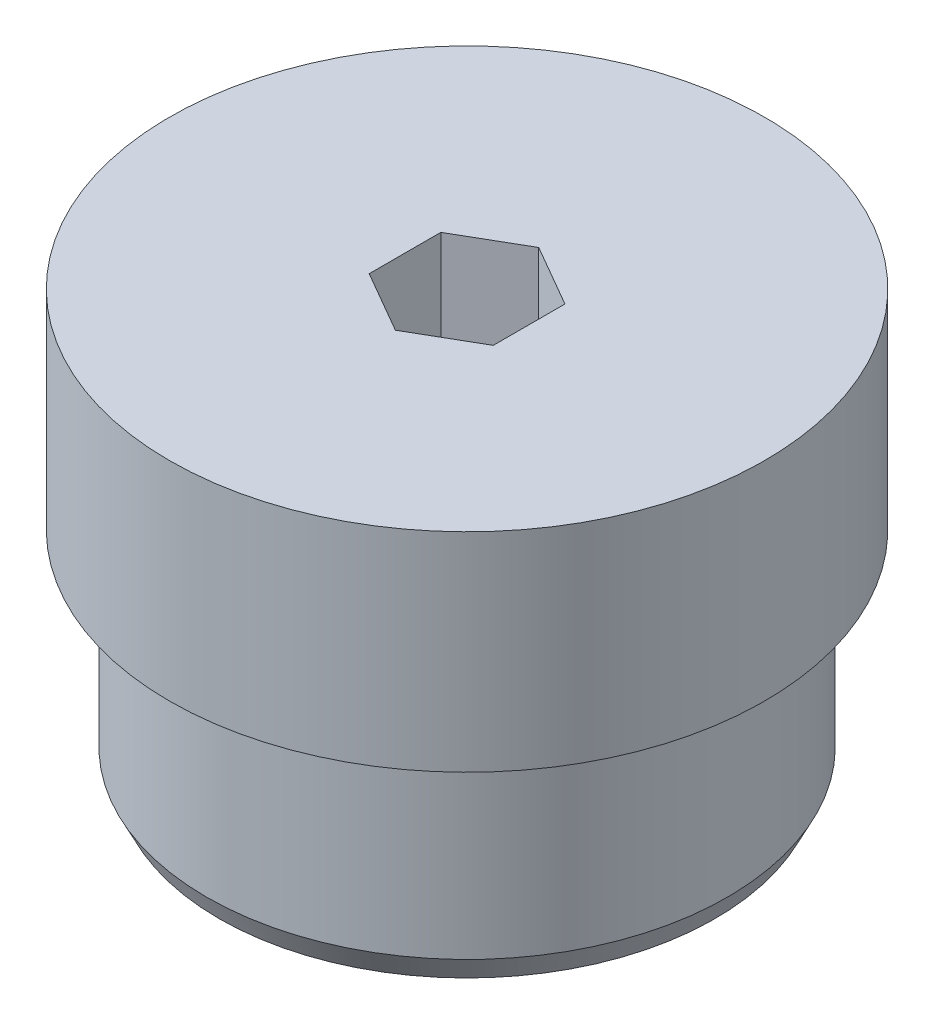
ISO-10303-21;
HEADER;
FILE_DESCRIPTION(('STEP AP214'),'2;1');
FILE_NAME('part.step','',(''),(''),'','','');
FILE_SCHEMA(('AUTOMOTIVE_DESIGN { 1 0 10303 214 1 1 1 1 }'));
ENDSEC;
DATA;
#1=APPLICATION_CONTEXT('core data for automotive mechanical design processes');
#2=APPLICATION_PROTOCOL_DEFINITION('international standard','automotive_design',2000,#1);
#3=PRODUCT_CONTEXT('',#1,'mechanical');
#4=PRODUCT('Part','Part','',(#3));
#5=PRODUCT_RELATED_PRODUCT_CATEGORY('part','',(#4));
#6=PRODUCT_DEFINITION_FORMATION('','',#4);
#7=PRODUCT_DEFINITION_CONTEXT('part definition',#1,'design');
#8=PRODUCT_DEFINITION('design','',#6,#7);
#9=PRODUCT_DEFINITION_SHAPE('','',#8);
#10=(LENGTH_UNIT() NAMED_UNIT(*) SI_UNIT(.MILLI.,.METRE.));
#11=(NAMED_UNIT(*) PLANE_ANGLE_UNIT() SI_UNIT($,.RADIAN.));
#12=(NAMED_UNIT(*) SI_UNIT($,.STERADIAN.) SOLID_ANGLE_UNIT());
#13=UNCERTAINTY_MEASURE_WITH_UNIT(LENGTH_MEASURE(1.E-05),#10,'distance_accuracy_value','');
#14=(GEOMETRIC_REPRESENTATION_CONTEXT(3) GLOBAL_UNCERTAINTY_ASSIGNED_CONTEXT((#13)) GLOBAL_UNIT_ASSIGNED_CONTEXT((#10,
#11,#12)) REPRESENTATION_CONTEXT('',''));
#15=CARTESIAN_POINT('',(0.,0.,0.));
#16=DIRECTION('',(0.,0.,1.));
#17=DIRECTION('',(1.,0.,0.));
#18=AXIS2_PLACEMENT_3D('',#15,#16,#17);
#19=CARTESIAN_POINT('',(-1.99999999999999,5.70470053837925,0.));
#20=DIRECTION('',(0.,-1.,0.));
#21=DIRECTION('',(0.,0.,-1.));
#22=AXIS2_PLACEMENT_3D('',#19,#20,#21);
#23=PLANE('',#22);
#24=DIRECTION('',(-0.866025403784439,0.,-0.5));
#25=VECTOR('',#24,1.);
#26=CARTESIAN_POINT('',(-2.12570335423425,5.70470053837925,0.217724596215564));
#27=LINE('',#26,#25);
#28=CARTESIAN_POINT('',(0.,5.70470053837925,1.445));
#29=VERTEX_POINT('',#28);
#30=CARTESIAN_POINT('',(-1.25140670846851,5.70470053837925,0.722499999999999));
#31=VERTEX_POINT('',#30);
#32=EDGE_CURVE('E129',#29,#31,#27,.T.);
#33=ORIENTED_EDGE('',*,*,#32,.F.);
#34=DIRECTION('',(-0.866025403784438,0.,0.500000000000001));
#35=VECTOR('',#34,1.);
#36=CARTESIAN_POINT('',(-0.874296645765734,5.70470053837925,1.94977540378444));
#37=LINE('',#36,#35);
#38=CARTESIAN_POINT('',(1.25140670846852,5.70470053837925,0.7225));
#39=VERTEX_POINT('',#38);
#40=EDGE_CURVE('E114',#39,#29,#37,.T.);
#41=ORIENTED_EDGE('',*,*,#40,.F.);
#42=DIRECTION('',(0.,0.,1.));
#43=VECTOR('',#42,1.);
#44=CARTESIAN_POINT('',(1.25140670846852,5.70470053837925,0.));
#45=LINE('',#44,#43);
#46=CARTESIAN_POINT('',(1.25140670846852,5.70470053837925,-0.722500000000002));
#47=VERTEX_POINT('',#46);
#48=EDGE_CURVE('E87',#47,#39,#45,.T.);
#49=ORIENTED_EDGE('',*,*,#48,.F.);
#50=DIRECTION('',(0.866025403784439,0.,0.499999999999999));
#51=VECTOR('',#50,1.);
#52=CARTESIAN_POINT('',(-0.874296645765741,5.70470053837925,-1.94977540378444));
#53=LINE('',#52,#51);
#54=CARTESIAN_POINT('',(0.,5.70470053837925,-1.445));
#55=VERTEX_POINT('',#54);
#56=EDGE_CURVE('E123',#55,#47,#53,.T.);
#57=ORIENTED_EDGE('',*,*,#56,.F.);
#58=DIRECTION('',(0.866025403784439,0.,-0.5));
#59=VECTOR('',#58,1.);
#60=CARTESIAN_POINT('',(-2.12570335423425,5.70470053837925,-0.217724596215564));
#61=LINE('',#60,#59);
#62=CARTESIAN_POINT('',(-1.25140670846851,5.70470053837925,-0.722500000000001));
#63=VERTEX_POINT('',#62);
#64=EDGE_CURVE('E125',#63,#55,#61,.T.);
#65=ORIENTED_EDGE('',*,*,#64,.F.);
#66=DIRECTION('',(0.,0.,-1.));
#67=VECTOR('',#66,1.);
#68=CARTESIAN_POINT('',(-1.25140670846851,5.70470053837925,0.));
#69=LINE('',#68,#67);
#70=EDGE_CURVE('E127',#31,#63,#69,.T.);
#71=ORIENTED_EDGE('',*,*,#70,.F.);
#72=EDGE_LOOP('',(#33,#41,#49,#57,#65,#71));
#73=FACE_BOUND('',#72,.T.);
#74=CARTESIAN_POINT('',(0.,5.70470053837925,0.));
#75=DIRECTION('',(0.,1.,0.));
#76=DIRECTION('',(0.,0.,1.));
#77=AXIS2_PLACEMENT_3D('',#74,#75,#76);
#78=CIRCLE('',#77,1.99999999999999);
#79=CARTESIAN_POINT('',(0.,5.70470053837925,1.99999999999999));
#80=VERTEX_POINT('',#79);
#81=EDGE_CURVE('E131',#80,#80,#78,.T.);
#82=ORIENTED_EDGE('',*,*,#81,.F.);
#83=EDGE_LOOP('',(#82));
#84=FACE_BOUND('',#83,.T.);
#85=ADVANCED_FACE('F29',(#73,#84),#23,.T.);
#86=CARTESIAN_POINT('',(-6.,8.5,0.));
#87=DIRECTION('',(0.,1.,0.));
#88=DIRECTION('',(0.,0.,1.));
#89=AXIS2_PLACEMENT_3D('',#86,#87,#88);
#90=PLANE('',#89);
#91=DIRECTION('',(0.866025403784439,0.,0.5));
#92=VECTOR('',#91,1.);
#93=CARTESIAN_POINT('',(-1.25140670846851,8.5,0.722499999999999));
#94=LINE('',#93,#92);
#95=CARTESIAN_POINT('',(-1.25140670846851,8.5,0.722499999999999));
#96=VERTEX_POINT('',#95);
#97=CARTESIAN_POINT('',(0.,8.5,1.445));
#98=VERTEX_POINT('',#97);
#99=EDGE_CURVE('E51',#96,#98,#94,.T.);
#100=ORIENTED_EDGE('',*,*,#99,.F.);
#101=DIRECTION('',(0.,0.,1.));
#102=VECTOR('',#101,1.);
#103=CARTESIAN_POINT('',(-1.25140670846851,8.5,-0.722500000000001));
#104=LINE('',#103,#102);
#105=CARTESIAN_POINT('',(-1.25140670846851,8.5,-0.722500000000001));
#106=VERTEX_POINT('',#105);
#107=EDGE_CURVE('E109',#106,#96,#104,.T.);
#108=ORIENTED_EDGE('',*,*,#107,.F.);
#109=DIRECTION('',(-0.866025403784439,0.,0.5));
#110=VECTOR('',#109,1.);
#111=CARTESIAN_POINT('',(0.,8.5,-1.445));
#112=LINE('',#111,#110);
#113=CARTESIAN_POINT('',(0.,8.5,-1.445));
#114=VERTEX_POINT('',#113);
#115=EDGE_CURVE('E103',#114,#106,#112,.T.);
#116=ORIENTED_EDGE('',*,*,#115,.F.);
#117=DIRECTION('',(-0.866025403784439,0.,-0.499999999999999));
#118=VECTOR('',#117,1.);
#119=CARTESIAN_POINT('',(1.25140670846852,8.5,-0.722500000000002));
#120=LINE('',#119,#118);
#121=CARTESIAN_POINT('',(1.25140670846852,8.5,-0.722500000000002));
#122=VERTEX_POINT('',#121);
#123=EDGE_CURVE('E101',#122,#114,#120,.T.);
#124=ORIENTED_EDGE('',*,*,#123,.F.);
#125=DIRECTION('',(0.,0.,-1.));
#126=VECTOR('',#125,1.);
#127=CARTESIAN_POINT('',(1.25140670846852,8.5,0.722499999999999));
#128=LINE('',#127,#126);
#129=CARTESIAN_POINT('',(1.25140670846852,8.5,0.722499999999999));
#130=VERTEX_POINT('',#129);
#131=EDGE_CURVE('E84',#130,#122,#128,.T.);
#132=ORIENTED_EDGE('',*,*,#131,.F.);
#133=DIRECTION('',(0.866025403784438,0.,-0.500000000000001));
#134=VECTOR('',#133,1.);
#135=CARTESIAN_POINT('',(0.,8.5,1.445));
#136=LINE('',#135,#134);
#137=EDGE_CURVE('E93',#98,#130,#136,.T.);
#138=ORIENTED_EDGE('',*,*,#137,.F.);
#139=EDGE_LOOP('',(#100,#108,#116,#124,#132,#138));
#140=FACE_BOUND('',#139,.T.);
#141=CARTESIAN_POINT('',(0.,8.5,0.));
#142=DIRECTION('',(0.,1.,0.));
#143=DIRECTION('',(0.,0.,1.));
#144=AXIS2_PLACEMENT_3D('',#141,#142,#143);
#145=CIRCLE('',#144,6.);
#146=CARTESIAN_POINT('',(0.,8.5,6.));
#147=VERTEX_POINT('',#146);
#148=EDGE_CURVE('E11',#147,#147,#145,.T.);
#149=ORIENTED_EDGE('',*,*,#148,.T.);
#150=EDGE_LOOP('',(#149));
#151=FACE_BOUND('',#150,.T.);
#152=ADVANCED_FACE('F97',(#140,#151),#90,.T.);
#153=CARTESIAN_POINT('',(0.,30.,0.));
#154=DIRECTION('',(0.,1.,0.));
#155=DIRECTION('',(0.,0.,1.));
#156=AXIS2_PLACEMENT_3D('',#153,#154,#155);
#157=CYLINDRICAL_SURFACE('',#156,6.);
#158=CARTESIAN_POINT('',(0.,4.3,0.));
#159=DIRECTION('',(0.,1.,0.));
#160=DIRECTION('',(0.,0.,1.));
#161=AXIS2_PLACEMENT_3D('',#158,#159,#160);
#162=CIRCLE('',#161,6.);
#163=CARTESIAN_POINT('',(0.,4.3,6.));
#164=VERTEX_POINT('',#163);
#165=EDGE_CURVE('E36',#164,#164,#162,.T.);
#166=ORIENTED_EDGE('',*,*,#165,.T.);
#167=EDGE_LOOP('',(#166));
#168=FACE_BOUND('',#167,.T.);
#169=ORIENTED_EDGE('',*,*,#148,.F.);
#170=EDGE_LOOP('',(#169));
#171=FACE_BOUND('',#170,.T.);
#172=ADVANCED_FACE('F154',(#168,#171),#157,.T.);
#173=CARTESIAN_POINT('',(-5.25,4.3,0.));
#174=DIRECTION('',(0.,-1.,0.));
#175=DIRECTION('',(0.,0.,-1.));
#176=AXIS2_PLACEMENT_3D('',#173,#174,#175);
#177=PLANE('',#176);
#178=CARTESIAN_POINT('',(0.,4.3,0.));
#179=DIRECTION('',(0.,1.,0.));
#180=DIRECTION('',(0.,0.,1.));
#181=AXIS2_PLACEMENT_3D('',#178,#179,#180);
#182=CIRCLE('',#181,5.25);
#183=CARTESIAN_POINT('',(0.,4.3,5.25));
#184=VERTEX_POINT('',#183);
#185=EDGE_CURVE('E149',#184,#184,#182,.T.);
#186=ORIENTED_EDGE('',*,*,#185,.T.);
#187=EDGE_LOOP('',(#186));
#188=FACE_BOUND('',#187,.T.);
#189=ORIENTED_EDGE('',*,*,#165,.F.);
#190=EDGE_LOOP('',(#189));
#191=FACE_BOUND('',#190,.T.);
#192=ADVANCED_FACE('F157',(#188,#191),#177,.T.);
#193=CARTESIAN_POINT('',(0.,30.,0.));
#194=DIRECTION('',(0.,1.,0.));
#195=DIRECTION('',(0.,0.,1.));
#196=AXIS2_PLACEMENT_3D('',#193,#194,#195);
#197=CYLINDRICAL_SURFACE('',#196,5.25);
#198=CARTESIAN_POINT('',(0.,0.5,0.));
#199=DIRECTION('',(0.,1.,0.));
#200=DIRECTION('',(0.,0.,1.));
#201=AXIS2_PLACEMENT_3D('',#198,#199,#200);
#202=CIRCLE('',#201,5.25);
#203=CARTESIAN_POINT('',(0.,0.5,5.25));
#204=VERTEX_POINT('',#203);
#205=EDGE_CURVE('E146',#204,#204,#202,.T.);
#206=ORIENTED_EDGE('',*,*,#205,.T.);
#207=EDGE_LOOP('',(#206));
#208=FACE_BOUND('',#207,.T.);
#209=ORIENTED_EDGE('',*,*,#185,.F.);
#210=EDGE_LOOP('',(#209));
#211=FACE_BOUND('',#210,.T.);
#212=ADVANCED_FACE('F159',(#208,#211),#197,.T.);
#213=CARTESIAN_POINT('',(0.,0.5,0.));
#214=DIRECTION('',(0.,1.,0.));
#215=DIRECTION('',(0.,0.,1.));
#216=AXIS2_PLACEMENT_3D('',#213,#214,#215);
#217=CONICAL_SURFACE('',#216,5.25,0.463647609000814);
#218=CARTESIAN_POINT('',(0.,0.,0.));
#219=DIRECTION('',(0.,1.,0.));
#220=DIRECTION('',(0.,0.,1.));
#221=AXIS2_PLACEMENT_3D('',#218,#219,#220);
#222=CIRCLE('',#221,4.99999999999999);
#223=CARTESIAN_POINT('',(0.,0.,4.99999999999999));
#224=VERTEX_POINT('',#223);
#225=EDGE_CURVE('E143',#224,#224,#222,.T.);
#226=ORIENTED_EDGE('',*,*,#225,.T.);
#227=EDGE_LOOP('',(#226));
#228=FACE_BOUND('',#227,.T.);
#229=ORIENTED_EDGE('',*,*,#205,.F.);
#230=EDGE_LOOP('',(#229));
#231=FACE_BOUND('',#230,.T.);
#232=ADVANCED_FACE('F166',(#228,#231),#217,.T.);
#233=CARTESIAN_POINT('',(-4.,0.,0.));
#234=DIRECTION('',(0.,-1.,0.));
#235=DIRECTION('',(0.,0.,-1.));
#236=AXIS2_PLACEMENT_3D('',#233,#234,#235);
#237=PLANE('',#236);
#238=CARTESIAN_POINT('',(0.,0.,0.));
#239=DIRECTION('',(0.,1.,0.));
#240=DIRECTION('',(0.,0.,1.));
#241=AXIS2_PLACEMENT_3D('',#238,#239,#240);
#242=CIRCLE('',#241,4.);
#243=CARTESIAN_POINT('',(0.,0.,4.));
#244=VERTEX_POINT('',#243);
#245=EDGE_CURVE('E140',#244,#244,#242,.T.);
#246=ORIENTED_EDGE('',*,*,#245,.T.);
#247=EDGE_LOOP('',(#246));
#248=FACE_BOUND('',#247,.T.);
#249=ORIENTED_EDGE('',*,*,#225,.F.);
#250=EDGE_LOOP('',(#249));
#251=FACE_BOUND('',#250,.T.);
#252=ADVANCED_FACE('F196',(#248,#251),#237,.T.);
#253=CARTESIAN_POINT('',(0.,30.,0.));
#254=DIRECTION('',(0.,1.,0.));
#255=DIRECTION('',(0.,0.,1.));
#256=AXIS2_PLACEMENT_3D('',#253,#254,#255);
#257=CYLINDRICAL_SURFACE('',#256,4.);
#258=CARTESIAN_POINT('',(0.,1.95,0.));
#259=DIRECTION('',(0.,1.,0.));
#260=DIRECTION('',(0.,0.,1.));
#261=AXIS2_PLACEMENT_3D('',#258,#259,#260);
#262=CIRCLE('',#261,4.);
#263=CARTESIAN_POINT('',(0.,1.95,4.));
#264=VERTEX_POINT('',#263);
#265=EDGE_CURVE('E137',#264,#264,#262,.T.);
#266=ORIENTED_EDGE('',*,*,#265,.T.);
#267=EDGE_LOOP('',(#266));
#268=FACE_BOUND('',#267,.T.);
#269=ORIENTED_EDGE('',*,*,#245,.F.);
#270=EDGE_LOOP('',(#269));
#271=FACE_BOUND('',#270,.T.);
#272=ADVANCED_FACE('F190',(#268,#271),#257,.F.);
#273=CARTESIAN_POINT('',(0.,1.95,0.));
#274=DIRECTION('',(0.,-1.,0.));
#275=DIRECTION('',(0.,0.,-1.));
#276=AXIS2_PLACEMENT_3D('',#273,#274,#275);
#277=CONICAL_SURFACE('',#276,4.,1.0471975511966);
#278=CARTESIAN_POINT('',(0.,3.10470053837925,0.));
#279=DIRECTION('',(0.,1.,0.));
#280=DIRECTION('',(0.,0.,1.));
#281=AXIS2_PLACEMENT_3D('',#278,#279,#280);
#282=CIRCLE('',#281,1.99999999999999);
#283=CARTESIAN_POINT('',(0.,3.10470053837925,1.99999999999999));
#284=VERTEX_POINT('',#283);
#285=EDGE_CURVE('E134',#284,#284,#282,.T.);
#286=ORIENTED_EDGE('',*,*,#285,.T.);
#287=EDGE_LOOP('',(#286));
#288=FACE_BOUND('',#287,.T.);
#289=ORIENTED_EDGE('',*,*,#265,.F.);
#290=EDGE_LOOP('',(#289));
#291=FACE_BOUND('',#290,.T.);
#292=ADVANCED_FACE('F184',(#288,#291),#277,.F.);
#293=CARTESIAN_POINT('',(0.,30.,0.));
#294=DIRECTION('',(0.,1.,0.));
#295=DIRECTION('',(0.,0.,1.));
#296=AXIS2_PLACEMENT_3D('',#293,#294,#295);
#297=CYLINDRICAL_SURFACE('',#296,1.99999999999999);
#298=ORIENTED_EDGE('',*,*,#81,.T.);
#299=EDGE_LOOP('',(#298));
#300=FACE_BOUND('',#299,.T.);
#301=ORIENTED_EDGE('',*,*,#285,.F.);
#302=EDGE_LOOP('',(#301));
#303=FACE_BOUND('',#302,.T.);
#304=ADVANCED_FACE('F180',(#300,#303),#297,.F.);
#305=CARTESIAN_POINT('',(-1.25140670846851,0.,0.722499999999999));
#306=DIRECTION('',(-0.5,0.,0.866025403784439));
#307=DIRECTION('',(0.866025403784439,0.,0.5));
#308=AXIS2_PLACEMENT_3D('',#305,#306,#307);
#309=PLANE('',#308);
#310=ORIENTED_EDGE('',*,*,#32,.T.);
#311=DIRECTION('',(0.,1.,0.));
#312=VECTOR('',#311,1.);
#313=CARTESIAN_POINT('',(-1.25140670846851,0.,0.722499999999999));
#314=LINE('',#313,#312);
#315=EDGE_CURVE('E112',#31,#96,#314,.T.);
#316=ORIENTED_EDGE('',*,*,#315,.T.);
#317=ORIENTED_EDGE('',*,*,#99,.T.);
#318=DIRECTION('',(0.,1.,0.));
#319=VECTOR('',#318,1.);
#320=CARTESIAN_POINT('',(0.,0.,1.445));
#321=LINE('',#320,#319);
#322=EDGE_CURVE('E90',#29,#98,#321,.T.);
#323=ORIENTED_EDGE('',*,*,#322,.F.);
#324=EDGE_LOOP('',(#310,#316,#317,#323));
#325=FACE_BOUND('',#324,.T.);
#326=ADVANCED_FACE('F183',(#325),#309,.F.);
#327=CARTESIAN_POINT('',(-1.25140670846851,0.,-0.722500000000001));
#328=DIRECTION('',(-1.,0.,0.));
#329=DIRECTION('',(0.,0.,1.));
#330=AXIS2_PLACEMENT_3D('',#327,#328,#329);
#331=PLANE('',#330);
#332=ORIENTED_EDGE('',*,*,#70,.T.);
#333=DIRECTION('',(0.,1.,0.));
#334=VECTOR('',#333,1.);
#335=CARTESIAN_POINT('',(-1.25140670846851,0.,-0.722500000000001));
#336=LINE('',#335,#334);
#337=EDGE_CURVE('E115',#63,#106,#336,.T.);
#338=ORIENTED_EDGE('',*,*,#337,.T.);
#339=ORIENTED_EDGE('',*,*,#107,.T.);
#340=ORIENTED_EDGE('',*,*,#315,.F.);
#341=EDGE_LOOP('',(#332,#338,#339,#340));
#342=FACE_BOUND('',#341,.T.);
#343=ADVANCED_FACE('F216',(#342),#331,.F.);
#344=CARTESIAN_POINT('',(0.,0.,-1.445));
#345=DIRECTION('',(-0.5,0.,-0.866025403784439));
#346=DIRECTION('',(-0.866025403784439,0.,0.5));
#347=AXIS2_PLACEMENT_3D('',#344,#345,#346);
#348=PLANE('',#347);
#349=ORIENTED_EDGE('',*,*,#64,.T.);
#350=DIRECTION('',(0.,1.,0.));
#351=VECTOR('',#350,1.);
#352=CARTESIAN_POINT('',(0.,0.,-1.445));
#353=LINE('',#352,#351);
#354=EDGE_CURVE('E117',#55,#114,#353,.T.);
#355=ORIENTED_EDGE('',*,*,#354,.T.);
#356=ORIENTED_EDGE('',*,*,#115,.T.);
#357=ORIENTED_EDGE('',*,*,#337,.F.);
#358=EDGE_LOOP('',(#349,#355,#356,#357));
#359=FACE_BOUND('',#358,.T.);
#360=ADVANCED_FACE('F224',(#359),#348,.F.);
#361=CARTESIAN_POINT('',(1.25140670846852,0.,-0.722500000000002));
#362=DIRECTION('',(0.499999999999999,0.,-0.866025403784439));
#363=DIRECTION('',(-0.866025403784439,0.,-0.499999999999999));
#364=AXIS2_PLACEMENT_3D('',#361,#362,#363);
#365=PLANE('',#364);
#366=ORIENTED_EDGE('',*,*,#56,.T.);
#367=DIRECTION('',(0.,1.,0.));
#368=VECTOR('',#367,1.);
#369=CARTESIAN_POINT('',(1.25140670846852,0.,-0.722500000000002));
#370=LINE('',#369,#368);
#371=EDGE_CURVE('E89',#47,#122,#370,.T.);
#372=ORIENTED_EDGE('',*,*,#371,.T.);
#373=ORIENTED_EDGE('',*,*,#123,.T.);
#374=ORIENTED_EDGE('',*,*,#354,.F.);
#375=EDGE_LOOP('',(#366,#372,#373,#374));
#376=FACE_BOUND('',#375,.T.);
#377=ADVANCED_FACE('F221',(#376),#365,.F.);
#378=CARTESIAN_POINT('',(1.25140670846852,0.,0.722499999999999));
#379=DIRECTION('',(1.,0.,0.));
#380=DIRECTION('',(0.,0.,-1.));
#381=AXIS2_PLACEMENT_3D('',#378,#379,#380);
#382=PLANE('',#381);
#383=ORIENTED_EDGE('',*,*,#48,.T.);
#384=DIRECTION('',(0.,1.,0.));
#385=VECTOR('',#384,1.);
#386=CARTESIAN_POINT('',(1.25140670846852,0.,0.722499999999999));
#387=LINE('',#386,#385);
#388=EDGE_CURVE('E43',#39,#130,#387,.T.);
#389=ORIENTED_EDGE('',*,*,#388,.T.);
#390=ORIENTED_EDGE('',*,*,#131,.T.);
#391=ORIENTED_EDGE('',*,*,#371,.F.);
#392=EDGE_LOOP('',(#383,#389,#390,#391));
#393=FACE_BOUND('',#392,.T.);
#394=ADVANCED_FACE('F81',(#393),#382,.F.);
#395=CARTESIAN_POINT('',(0.,0.,1.445));
#396=DIRECTION('',(0.500000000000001,0.,0.866025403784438));
#397=DIRECTION('',(0.866025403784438,0.,-0.500000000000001));
#398=AXIS2_PLACEMENT_3D('',#395,#396,#397);
#399=PLANE('',#398);
#400=ORIENTED_EDGE('',*,*,#40,.T.);
#401=ORIENTED_EDGE('',*,*,#322,.T.);
#402=ORIENTED_EDGE('',*,*,#137,.T.);
#403=ORIENTED_EDGE('',*,*,#388,.F.);
#404=EDGE_LOOP('',(#400,#401,#402,#403));
#405=FACE_BOUND('',#404,.T.);
#406=ADVANCED_FACE('F94',(#405),#399,.F.);
#407=CLOSED_SHELL('',(#85,#152,#172,#192,#212,#232,#252,#272,#292,#304,#326,#343,#360,#377,#394,#406));
#408=MANIFOLD_SOLID_BREP('B2',#407);
#409=ADVANCED_BREP_SHAPE_REPRESENTATION('',(#18,#408),#14);
#410=SHAPE_DEFINITION_REPRESENTATION(#9,#409);
ENDSEC;
END-ISO-10303-21;
